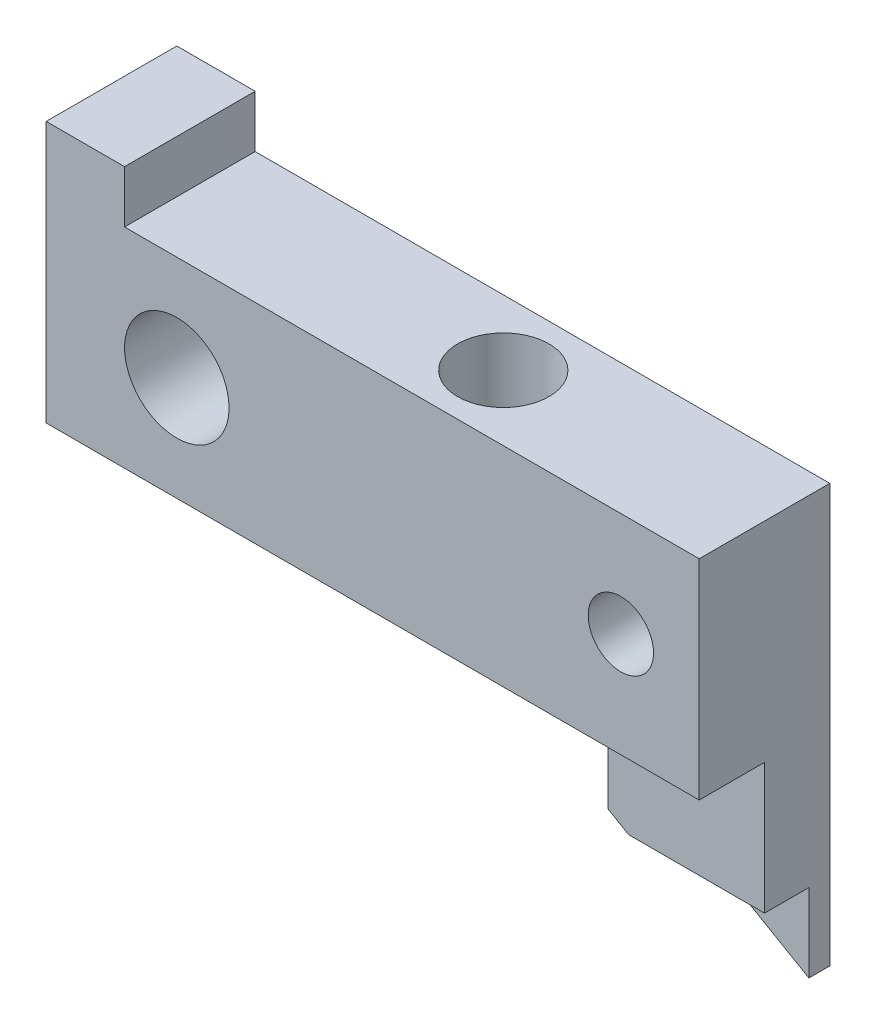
ISO-10303-21;
HEADER;
FILE_DESCRIPTION(('STEP AP214'),'2;1');
FILE_NAME('part.step','',(''),(''),'','','');
FILE_SCHEMA(('AUTOMOTIVE_DESIGN { 1 0 10303 214 1 1 1 1 }'));
ENDSEC;
DATA;
#1=APPLICATION_CONTEXT('core data for automotive mechanical design processes');
#2=APPLICATION_PROTOCOL_DEFINITION('international standard','automotive_design',2000,#1);
#3=PRODUCT_CONTEXT('',#1,'mechanical');
#4=PRODUCT('Part','Part','',(#3));
#5=PRODUCT_RELATED_PRODUCT_CATEGORY('part','',(#4));
#6=PRODUCT_DEFINITION_FORMATION('','',#4);
#7=PRODUCT_DEFINITION_CONTEXT('part definition',#1,'design');
#8=PRODUCT_DEFINITION('design','',#6,#7);
#9=PRODUCT_DEFINITION_SHAPE('','',#8);
#10=(LENGTH_UNIT() NAMED_UNIT(*) SI_UNIT(.MILLI.,.METRE.));
#11=(NAMED_UNIT(*) PLANE_ANGLE_UNIT() SI_UNIT($,.RADIAN.));
#12=(NAMED_UNIT(*) SI_UNIT($,.STERADIAN.) SOLID_ANGLE_UNIT());
#13=UNCERTAINTY_MEASURE_WITH_UNIT(LENGTH_MEASURE(1.E-05),#10,'distance_accuracy_value','');
#14=(GEOMETRIC_REPRESENTATION_CONTEXT(3) GLOBAL_UNCERTAINTY_ASSIGNED_CONTEXT((#13)) GLOBAL_UNIT_ASSIGNED_CONTEXT((#10,
#11,#12)) REPRESENTATION_CONTEXT('',''));
#15=CARTESIAN_POINT('',(0.,0.,0.));
#16=DIRECTION('',(0.,0.,1.));
#17=DIRECTION('',(1.,0.,0.));
#18=AXIS2_PLACEMENT_3D('',#15,#16,#17);
#19=CARTESIAN_POINT('',(19.,8.,5.));
#20=DIRECTION('',(0.,0.,-1.));
#21=DIRECTION('',(-1.,0.,0.));
#22=AXIS2_PLACEMENT_3D('',#19,#20,#21);
#23=PLANE('',#22);
#24=CARTESIAN_POINT('',(22.,12.,5.));
#25=DIRECTION('',(0.,0.,1.));
#26=DIRECTION('',(1.,0.,0.));
#27=AXIS2_PLACEMENT_3D('',#24,#25,#26);
#28=CIRCLE('',#27,1.25);
#29=CARTESIAN_POINT('',(23.25,12.,5.));
#30=VERTEX_POINT('',#29);
#31=EDGE_CURVE('E218',#30,#30,#28,.T.);
#32=ORIENTED_EDGE('',*,*,#31,.F.);
#33=EDGE_LOOP('',(#32));
#34=FACE_BOUND('',#33,.T.);
#35=CARTESIAN_POINT('',(5.,12.,5.));
#36=DIRECTION('',(0.,0.,1.));
#37=DIRECTION('',(1.,0.,0.));
#38=AXIS2_PLACEMENT_3D('',#35,#36,#37);
#39=CIRCLE('',#38,2.);
#40=CARTESIAN_POINT('',(7.,12.,5.));
#41=VERTEX_POINT('',#40);
#42=EDGE_CURVE('E136',#41,#41,#39,.T.);
#43=ORIENTED_EDGE('',*,*,#42,.F.);
#44=EDGE_LOOP('',(#43));
#45=FACE_BOUND('',#44,.T.);
#46=DIRECTION('',(1.,0.,0.));
#47=VECTOR('',#46,1.);
#48=CARTESIAN_POINT('',(0.,8.,5.));
#49=LINE('',#48,#47);
#50=CARTESIAN_POINT('',(0.,8.,5.));
#51=VERTEX_POINT('',#50);
#52=CARTESIAN_POINT('',(25.,8.,5.));
#53=VERTEX_POINT('',#52);
#54=EDGE_CURVE('E128',#51,#53,#49,.T.);
#55=ORIENTED_EDGE('',*,*,#54,.T.);
#56=DIRECTION('',(0.,1.,0.));
#57=VECTOR('',#56,1.);
#58=CARTESIAN_POINT('',(25.,0.,5.));
#59=LINE('',#58,#57);
#60=CARTESIAN_POINT('',(25.,16.,5.));
#61=VERTEX_POINT('',#60);
#62=EDGE_CURVE('E97',#53,#61,#59,.T.);
#63=ORIENTED_EDGE('',*,*,#62,.T.);
#64=DIRECTION('',(-1.,0.,0.));
#65=VECTOR('',#64,1.);
#66=CARTESIAN_POINT('',(3.,16.,5.));
#67=LINE('',#66,#65);
#68=CARTESIAN_POINT('',(3.,16.,5.));
#69=VERTEX_POINT('',#68);
#70=EDGE_CURVE('E110',#61,#69,#67,.T.);
#71=ORIENTED_EDGE('',*,*,#70,.T.);
#72=DIRECTION('',(0.,1.,0.));
#73=VECTOR('',#72,1.);
#74=CARTESIAN_POINT('',(3.,16.,5.));
#75=LINE('',#74,#73);
#76=CARTESIAN_POINT('',(3.,18.,5.));
#77=VERTEX_POINT('',#76);
#78=EDGE_CURVE('E104',#69,#77,#75,.T.);
#79=ORIENTED_EDGE('',*,*,#78,.T.);
#80=DIRECTION('',(-1.,0.,0.));
#81=VECTOR('',#80,1.);
#82=CARTESIAN_POINT('',(0.,18.,5.));
#83=LINE('',#82,#81);
#84=CARTESIAN_POINT('',(0.,18.,5.));
#85=VERTEX_POINT('',#84);
#86=EDGE_CURVE('E107',#77,#85,#83,.T.);
#87=ORIENTED_EDGE('',*,*,#86,.T.);
#88=DIRECTION('',(0.,-1.,0.));
#89=VECTOR('',#88,1.);
#90=CARTESIAN_POINT('',(0.,8.,5.));
#91=LINE('',#90,#89);
#92=EDGE_CURVE('E57',#85,#51,#91,.T.);
#93=ORIENTED_EDGE('',*,*,#92,.T.);
#94=EDGE_LOOP('',(#55,#63,#71,#79,#87,#93));
#95=FACE_BOUND('',#94,.T.);
#96=ADVANCED_FACE('F33',(#34,#45,#95),#23,.F.);
#97=CARTESIAN_POINT('',(19.,3.46410161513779,5.));
#98=DIRECTION('',(1.,0.,0.));
#99=DIRECTION('',(0.,0.,-1.));
#100=AXIS2_PLACEMENT_3D('',#97,#98,#99);
#101=PLANE('',#100);
#102=DIRECTION('',(0.,-1.,0.));
#103=VECTOR('',#102,1.);
#104=CARTESIAN_POINT('',(19.,3.46410161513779,2.5));
#105=LINE('',#104,#103);
#106=CARTESIAN_POINT('',(19.,8.,2.5));
#107=VERTEX_POINT('',#106);
#108=CARTESIAN_POINT('',(19.,3.46410161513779,2.5));
#109=VERTEX_POINT('',#108);
#110=EDGE_CURVE('E199',#107,#109,#105,.T.);
#111=ORIENTED_EDGE('',*,*,#110,.F.);
#112=DIRECTION('',(0.,0.,-1.));
#113=VECTOR('',#112,1.);
#114=CARTESIAN_POINT('',(19.,8.,5.));
#115=LINE('',#114,#113);
#116=CARTESIAN_POINT('',(19.,8.,0.));
#117=VERTEX_POINT('',#116);
#118=EDGE_CURVE('E90',#107,#117,#115,.T.);
#119=ORIENTED_EDGE('',*,*,#118,.T.);
#120=DIRECTION('',(0.,-1.,0.));
#121=VECTOR('',#120,1.);
#122=CARTESIAN_POINT('',(19.,3.46410161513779,0.));
#123=LINE('',#122,#121);
#124=CARTESIAN_POINT('',(19.,3.46410161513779,0.));
#125=VERTEX_POINT('',#124);
#126=EDGE_CURVE('E133',#117,#125,#123,.T.);
#127=ORIENTED_EDGE('',*,*,#126,.T.);
#128=DIRECTION('',(0.,0.,-1.));
#129=VECTOR('',#128,1.);
#130=CARTESIAN_POINT('',(19.,3.46410161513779,5.));
#131=LINE('',#130,#129);
#132=EDGE_CURVE('E12',#109,#125,#131,.T.);
#133=ORIENTED_EDGE('',*,*,#132,.F.);
#134=EDGE_LOOP('',(#111,#119,#127,#133));
#135=FACE_BOUND('',#134,.T.);
#136=ADVANCED_FACE('F35',(#135),#101,.F.);
#137=CARTESIAN_POINT('',(19.,3.46410161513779,5.));
#138=DIRECTION('',(0.500000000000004,0.866025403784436,0.));
#139=DIRECTION('',(-0.866025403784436,0.500000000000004,0.));
#140=AXIS2_PLACEMENT_3D('',#137,#138,#139);
#141=PLANE('',#140);
#142=DIRECTION('',(0.866025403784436,-0.500000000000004,0.));
#143=VECTOR('',#142,1.);
#144=CARTESIAN_POINT('',(19.,3.46410161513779,0.80000000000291));
#145=LINE('',#144,#143);
#146=CARTESIAN_POINT('',(19.8038475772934,3.,0.80000000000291));
#147=VERTEX_POINT('',#146);
#148=CARTESIAN_POINT('',(25.,0.,0.800000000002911));
#149=VERTEX_POINT('',#148);
#150=EDGE_CURVE('E191',#147,#149,#145,.T.);
#151=ORIENTED_EDGE('',*,*,#150,.F.);
#152=DIRECTION('',(0.,0.,-1.));
#153=VECTOR('',#152,1.);
#154=CARTESIAN_POINT('',(19.8038475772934,3.,5.));
#155=LINE('',#154,#153);
#156=CARTESIAN_POINT('',(19.8038475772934,3.,2.5));
#157=VERTEX_POINT('',#156);
#158=EDGE_CURVE('E196',#157,#147,#155,.T.);
#159=ORIENTED_EDGE('',*,*,#158,.F.);
#160=DIRECTION('',(0.866025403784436,-0.500000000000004,0.));
#161=VECTOR('',#160,1.);
#162=CARTESIAN_POINT('',(19.,3.46410161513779,2.5));
#163=LINE('',#162,#161);
#164=EDGE_CURVE('E202',#109,#157,#163,.T.);
#165=ORIENTED_EDGE('',*,*,#164,.F.);
#166=ORIENTED_EDGE('',*,*,#132,.T.);
#167=DIRECTION('',(0.866025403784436,-0.500000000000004,0.));
#168=VECTOR('',#167,1.);
#169=CARTESIAN_POINT('',(19.,3.46410161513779,0.));
#170=LINE('',#169,#168);
#171=CARTESIAN_POINT('',(25.,0.,0.));
#172=VERTEX_POINT('',#171);
#173=EDGE_CURVE('E135',#125,#172,#170,.T.);
#174=ORIENTED_EDGE('',*,*,#173,.T.);
#175=DIRECTION('',(0.,0.,-1.));
#176=VECTOR('',#175,1.);
#177=CARTESIAN_POINT('',(25.,0.,5.));
#178=LINE('',#177,#176);
#179=EDGE_CURVE('E41',#149,#172,#178,.T.);
#180=ORIENTED_EDGE('',*,*,#179,.F.);
#181=EDGE_LOOP('',(#151,#159,#165,#166,#174,#180));
#182=FACE_BOUND('',#181,.T.);
#183=ADVANCED_FACE('F170',(#182),#141,.F.);
#184=CARTESIAN_POINT('',(25.,0.,5.));
#185=DIRECTION('',(-1.,0.,0.));
#186=DIRECTION('',(0.,0.,1.));
#187=AXIS2_PLACEMENT_3D('',#184,#185,#186);
#188=PLANE('',#187);
#189=DIRECTION('',(0.,-1.,0.));
#190=VECTOR('',#189,1.);
#191=CARTESIAN_POINT('',(25.,0.,0.80000000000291));
#192=LINE('',#191,#190);
#193=CARTESIAN_POINT('',(25.,3.,0.80000000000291));
#194=VERTEX_POINT('',#193);
#195=EDGE_CURVE('E166',#194,#149,#192,.T.);
#196=ORIENTED_EDGE('',*,*,#195,.T.);
#197=ORIENTED_EDGE('',*,*,#179,.T.);
#198=DIRECTION('',(0.,1.,0.));
#199=VECTOR('',#198,1.);
#200=CARTESIAN_POINT('',(25.,0.,0.));
#201=LINE('',#200,#199);
#202=CARTESIAN_POINT('',(25.,16.,0.));
#203=VERTEX_POINT('',#202);
#204=EDGE_CURVE('E139',#172,#203,#201,.T.);
#205=ORIENTED_EDGE('',*,*,#204,.T.);
#206=DIRECTION('',(0.,0.,-1.));
#207=VECTOR('',#206,1.);
#208=CARTESIAN_POINT('',(25.,16.,5.));
#209=LINE('',#208,#207);
#210=EDGE_CURVE('E156',#61,#203,#209,.T.);
#211=ORIENTED_EDGE('',*,*,#210,.F.);
#212=ORIENTED_EDGE('',*,*,#62,.F.);
#213=DIRECTION('',(0.,0.,-1.));
#214=VECTOR('',#213,1.);
#215=CARTESIAN_POINT('',(25.,8.,5.));
#216=LINE('',#215,#214);
#217=CARTESIAN_POINT('',(25.,8.,2.5));
#218=VERTEX_POINT('',#217);
#219=EDGE_CURVE('E183',#53,#218,#216,.T.);
#220=ORIENTED_EDGE('',*,*,#219,.T.);
#221=DIRECTION('',(0.,-1.,0.));
#222=VECTOR('',#221,1.);
#223=CARTESIAN_POINT('',(25.,3.,2.5));
#224=LINE('',#223,#222);
#225=CARTESIAN_POINT('',(25.,3.,2.5));
#226=VERTEX_POINT('',#225);
#227=EDGE_CURVE('E48',#218,#226,#224,.T.);
#228=ORIENTED_EDGE('',*,*,#227,.T.);
#229=DIRECTION('',(0.,0.,-1.));
#230=VECTOR('',#229,1.);
#231=CARTESIAN_POINT('',(25.,3.,2.5));
#232=LINE('',#231,#230);
#233=EDGE_CURVE('E209',#226,#194,#232,.T.);
#234=ORIENTED_EDGE('',*,*,#233,.T.);
#235=EDGE_LOOP('',(#196,#197,#205,#211,#212,#220,#228,#234));
#236=FACE_BOUND('',#235,.T.);
#237=ADVANCED_FACE('F161',(#236),#188,.F.);
#238=CARTESIAN_POINT('',(19.,8.,0.));
#239=DIRECTION('',(0.,0.,-1.));
#240=DIRECTION('',(-1.,0.,0.));
#241=AXIS2_PLACEMENT_3D('',#238,#239,#240);
#242=PLANE('',#241);
#243=CARTESIAN_POINT('',(22.,12.,0.));
#244=DIRECTION('',(0.,0.,1.));
#245=DIRECTION('',(1.,0.,0.));
#246=AXIS2_PLACEMENT_3D('',#243,#244,#245);
#247=CIRCLE('',#246,1.25);
#248=CARTESIAN_POINT('',(23.25,12.,0.));
#249=VERTEX_POINT('',#248);
#250=EDGE_CURVE('E217',#249,#249,#247,.T.);
#251=ORIENTED_EDGE('',*,*,#250,.T.);
#252=EDGE_LOOP('',(#251));
#253=FACE_BOUND('',#252,.T.);
#254=ORIENTED_EDGE('',*,*,#126,.F.);
#255=DIRECTION('',(1.,0.,0.));
#256=VECTOR('',#255,1.);
#257=CARTESIAN_POINT('',(0.,8.,0.));
#258=LINE('',#257,#256);
#259=CARTESIAN_POINT('',(0.,8.,0.));
#260=VERTEX_POINT('',#259);
#261=EDGE_CURVE('E149',#260,#117,#258,.T.);
#262=ORIENTED_EDGE('',*,*,#261,.F.);
#263=DIRECTION('',(0.,-1.,0.));
#264=VECTOR('',#263,1.);
#265=CARTESIAN_POINT('',(0.,8.,0.));
#266=LINE('',#265,#264);
#267=CARTESIAN_POINT('',(0.,18.,0.));
#268=VERTEX_POINT('',#267);
#269=EDGE_CURVE('E146',#268,#260,#266,.T.);
#270=ORIENTED_EDGE('',*,*,#269,.F.);
#271=DIRECTION('',(-1.,0.,0.));
#272=VECTOR('',#271,1.);
#273=CARTESIAN_POINT('',(0.,18.,0.));
#274=LINE('',#273,#272);
#275=CARTESIAN_POINT('',(3.,18.,0.));
#276=VERTEX_POINT('',#275);
#277=EDGE_CURVE('E144',#276,#268,#274,.T.);
#278=ORIENTED_EDGE('',*,*,#277,.F.);
#279=DIRECTION('',(0.,1.,0.));
#280=VECTOR('',#279,1.);
#281=CARTESIAN_POINT('',(3.,16.,0.));
#282=LINE('',#281,#280);
#283=CARTESIAN_POINT('',(3.,16.,0.));
#284=VERTEX_POINT('',#283);
#285=EDGE_CURVE('E119',#284,#276,#282,.T.);
#286=ORIENTED_EDGE('',*,*,#285,.F.);
#287=DIRECTION('',(-1.,0.,0.));
#288=VECTOR('',#287,1.);
#289=CARTESIAN_POINT('',(3.,16.,0.));
#290=LINE('',#289,#288);
#291=EDGE_CURVE('E141',#203,#284,#290,.T.);
#292=ORIENTED_EDGE('',*,*,#291,.F.);
#293=ORIENTED_EDGE('',*,*,#204,.F.);
#294=ORIENTED_EDGE('',*,*,#173,.F.);
#295=EDGE_LOOP('',(#254,#262,#270,#278,#286,#292,#293,#294));
#296=FACE_BOUND('',#295,.T.);
#297=CARTESIAN_POINT('',(5.,12.,0.));
#298=DIRECTION('',(0.,0.,1.));
#299=DIRECTION('',(1.,0.,0.));
#300=AXIS2_PLACEMENT_3D('',#297,#298,#299);
#301=CIRCLE('',#300,2.);
#302=CARTESIAN_POINT('',(7.,12.,0.));
#303=VERTEX_POINT('',#302);
#304=EDGE_CURVE('E188',#303,#303,#301,.T.);
#305=ORIENTED_EDGE('',*,*,#304,.T.);
#306=EDGE_LOOP('',(#305));
#307=FACE_BOUND('',#306,.T.);
#308=ADVANCED_FACE('F176',(#253,#296,#307),#242,.T.);
#309=CARTESIAN_POINT('',(3.,16.,5.));
#310=DIRECTION('',(0.,-1.,0.));
#311=DIRECTION('',(0.,0.,-1.));
#312=AXIS2_PLACEMENT_3D('',#309,#310,#311);
#313=PLANE('',#312);
#314=CARTESIAN_POINT('',(15.,16.,2.5));
#315=DIRECTION('',(0.,1.,0.));
#316=DIRECTION('',(0.,0.,1.));
#317=AXIS2_PLACEMENT_3D('',#314,#315,#316);
#318=CIRCLE('',#317,1.75);
#319=CARTESIAN_POINT('',(15.,16.,4.25));
#320=VERTEX_POINT('',#319);
#321=EDGE_CURVE('E224',#320,#320,#318,.T.);
#322=ORIENTED_EDGE('',*,*,#321,.F.);
#323=EDGE_LOOP('',(#322));
#324=FACE_BOUND('',#323,.T.);
#325=ORIENTED_EDGE('',*,*,#291,.T.);
#326=DIRECTION('',(0.,0.,-1.));
#327=VECTOR('',#326,1.);
#328=CARTESIAN_POINT('',(3.,16.,5.));
#329=LINE('',#328,#327);
#330=EDGE_CURVE('E122',#69,#284,#329,.T.);
#331=ORIENTED_EDGE('',*,*,#330,.F.);
#332=ORIENTED_EDGE('',*,*,#70,.F.);
#333=ORIENTED_EDGE('',*,*,#210,.T.);
#334=EDGE_LOOP('',(#325,#331,#332,#333));
#335=FACE_BOUND('',#334,.T.);
#336=ADVANCED_FACE('F179',(#324,#335),#313,.F.);
#337=CARTESIAN_POINT('',(3.,16.,5.));
#338=DIRECTION('',(-1.,0.,0.));
#339=DIRECTION('',(0.,0.,1.));
#340=AXIS2_PLACEMENT_3D('',#337,#338,#339);
#341=PLANE('',#340);
#342=ORIENTED_EDGE('',*,*,#285,.T.);
#343=DIRECTION('',(0.,0.,-1.));
#344=VECTOR('',#343,1.);
#345=CARTESIAN_POINT('',(3.,18.,5.));
#346=LINE('',#345,#344);
#347=EDGE_CURVE('E116',#77,#276,#346,.T.);
#348=ORIENTED_EDGE('',*,*,#347,.F.);
#349=ORIENTED_EDGE('',*,*,#78,.F.);
#350=ORIENTED_EDGE('',*,*,#330,.T.);
#351=EDGE_LOOP('',(#342,#348,#349,#350));
#352=FACE_BOUND('',#351,.T.);
#353=ADVANCED_FACE('F117',(#352),#341,.F.);
#354=CARTESIAN_POINT('',(0.,18.,5.));
#355=DIRECTION('',(0.,-1.,0.));
#356=DIRECTION('',(0.,0.,-1.));
#357=AXIS2_PLACEMENT_3D('',#354,#355,#356);
#358=PLANE('',#357);
#359=ORIENTED_EDGE('',*,*,#277,.T.);
#360=DIRECTION('',(0.,0.,-1.));
#361=VECTOR('',#360,1.);
#362=CARTESIAN_POINT('',(0.,18.,5.));
#363=LINE('',#362,#361);
#364=EDGE_CURVE('E123',#85,#268,#363,.T.);
#365=ORIENTED_EDGE('',*,*,#364,.F.);
#366=ORIENTED_EDGE('',*,*,#86,.F.);
#367=ORIENTED_EDGE('',*,*,#347,.T.);
#368=EDGE_LOOP('',(#359,#365,#366,#367));
#369=FACE_BOUND('',#368,.T.);
#370=ADVANCED_FACE('F125',(#369),#358,.F.);
#371=CARTESIAN_POINT('',(0.,8.,5.));
#372=DIRECTION('',(1.,0.,0.));
#373=DIRECTION('',(0.,0.,-1.));
#374=AXIS2_PLACEMENT_3D('',#371,#372,#373);
#375=PLANE('',#374);
#376=ORIENTED_EDGE('',*,*,#269,.T.);
#377=DIRECTION('',(0.,0.,-1.));
#378=VECTOR('',#377,1.);
#379=CARTESIAN_POINT('',(0.,8.,5.));
#380=LINE('',#379,#378);
#381=EDGE_CURVE('E152',#51,#260,#380,.T.);
#382=ORIENTED_EDGE('',*,*,#381,.F.);
#383=ORIENTED_EDGE('',*,*,#92,.F.);
#384=ORIENTED_EDGE('',*,*,#364,.T.);
#385=EDGE_LOOP('',(#376,#382,#383,#384));
#386=FACE_BOUND('',#385,.T.);
#387=ADVANCED_FACE('F264',(#386),#375,.F.);
#388=CARTESIAN_POINT('',(0.,8.,5.));
#389=DIRECTION('',(0.,1.,0.));
#390=DIRECTION('',(0.,0.,1.));
#391=AXIS2_PLACEMENT_3D('',#388,#389,#390);
#392=PLANE('',#391);
#393=ORIENTED_EDGE('',*,*,#381,.T.);
#394=ORIENTED_EDGE('',*,*,#261,.T.);
#395=ORIENTED_EDGE('',*,*,#118,.F.);
#396=DIRECTION('',(1.,0.,0.));
#397=VECTOR('',#396,1.);
#398=CARTESIAN_POINT('',(0.,8.,2.5));
#399=LINE('',#398,#397);
#400=EDGE_CURVE('E206',#107,#218,#399,.T.);
#401=ORIENTED_EDGE('',*,*,#400,.T.);
#402=ORIENTED_EDGE('',*,*,#219,.F.);
#403=ORIENTED_EDGE('',*,*,#54,.F.);
#404=EDGE_LOOP('',(#393,#394,#395,#401,#402,#403));
#405=FACE_BOUND('',#404,.T.);
#406=ADVANCED_FACE('F261',(#405),#392,.F.);
#407=CARTESIAN_POINT('',(5.,12.,5.));
#408=DIRECTION('',(0.,0.,-1.));
#409=DIRECTION('',(-1.,0.,0.));
#410=AXIS2_PLACEMENT_3D('',#407,#408,#409);
#411=CYLINDRICAL_SURFACE('',#410,2.);
#412=ORIENTED_EDGE('',*,*,#42,.T.);
#413=EDGE_LOOP('',(#412));
#414=FACE_BOUND('',#413,.T.);
#415=ORIENTED_EDGE('',*,*,#304,.F.);
#416=EDGE_LOOP('',(#415));
#417=FACE_BOUND('',#416,.T.);
#418=ADVANCED_FACE('F258',(#414,#417),#411,.F.);
#419=CARTESIAN_POINT('',(0.,0.,0.80000000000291));
#420=DIRECTION('',(0.,0.,1.));
#421=DIRECTION('',(1.,0.,0.));
#422=AXIS2_PLACEMENT_3D('',#419,#420,#421);
#423=PLANE('',#422);
#424=ORIENTED_EDGE('',*,*,#150,.T.);
#425=ORIENTED_EDGE('',*,*,#195,.F.);
#426=DIRECTION('',(1.,0.,0.));
#427=VECTOR('',#426,1.);
#428=CARTESIAN_POINT('',(0.,3.,0.80000000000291));
#429=LINE('',#428,#427);
#430=EDGE_CURVE('E205',#147,#194,#429,.T.);
#431=ORIENTED_EDGE('',*,*,#430,.F.);
#432=EDGE_LOOP('',(#424,#425,#431));
#433=FACE_BOUND('',#432,.T.);
#434=ADVANCED_FACE('F290',(#433),#423,.T.);
#435=CARTESIAN_POINT('',(0.,3.,2.5));
#436=DIRECTION('',(0.,-1.,0.));
#437=DIRECTION('',(0.,0.,-1.));
#438=AXIS2_PLACEMENT_3D('',#435,#436,#437);
#439=PLANE('',#438);
#440=ORIENTED_EDGE('',*,*,#158,.T.);
#441=ORIENTED_EDGE('',*,*,#430,.T.);
#442=ORIENTED_EDGE('',*,*,#233,.F.);
#443=DIRECTION('',(1.,0.,0.));
#444=VECTOR('',#443,1.);
#445=CARTESIAN_POINT('',(0.,3.,2.5));
#446=LINE('',#445,#444);
#447=EDGE_CURVE('E208',#157,#226,#446,.T.);
#448=ORIENTED_EDGE('',*,*,#447,.F.);
#449=EDGE_LOOP('',(#440,#441,#442,#448));
#450=FACE_BOUND('',#449,.T.);
#451=ADVANCED_FACE('F297',(#450),#439,.T.);
#452=CARTESIAN_POINT('',(0.,3.,2.5));
#453=DIRECTION('',(0.,0.,1.));
#454=DIRECTION('',(1.,0.,0.));
#455=AXIS2_PLACEMENT_3D('',#452,#453,#454);
#456=PLANE('',#455);
#457=ORIENTED_EDGE('',*,*,#110,.T.);
#458=ORIENTED_EDGE('',*,*,#164,.T.);
#459=ORIENTED_EDGE('',*,*,#447,.T.);
#460=ORIENTED_EDGE('',*,*,#227,.F.);
#461=ORIENTED_EDGE('',*,*,#400,.F.);
#462=EDGE_LOOP('',(#457,#458,#459,#460,#461));
#463=FACE_BOUND('',#462,.T.);
#464=ADVANCED_FACE('F304',(#463),#456,.T.);
#465=CARTESIAN_POINT('',(22.,12.,0.));
#466=DIRECTION('',(0.,0.,1.));
#467=DIRECTION('',(1.,0.,0.));
#468=AXIS2_PLACEMENT_3D('',#465,#466,#467);
#469=CYLINDRICAL_SURFACE('',#468,1.25);
#470=ORIENTED_EDGE('',*,*,#250,.F.);
#471=EDGE_LOOP('',(#470));
#472=FACE_BOUND('',#471,.T.);
#473=ORIENTED_EDGE('',*,*,#31,.T.);
#474=EDGE_LOOP('',(#473));
#475=FACE_BOUND('',#474,.T.);
#476=ADVANCED_FACE('F235',(#472,#475),#469,.F.);
#477=CARTESIAN_POINT('',(15.,13.,2.5));
#478=DIRECTION('',(0.,1.,0.));
#479=DIRECTION('',(0.,0.,1.));
#480=AXIS2_PLACEMENT_3D('',#477,#478,#479);
#481=CYLINDRICAL_SURFACE('',#480,1.75);
#482=CARTESIAN_POINT('',(15.,13.,2.5));
#483=DIRECTION('',(0.,1.,0.));
#484=DIRECTION('',(0.,0.,1.));
#485=AXIS2_PLACEMENT_3D('',#482,#483,#484);
#486=CIRCLE('',#485,1.75);
#487=CARTESIAN_POINT('',(15.,13.,4.25));
#488=VERTEX_POINT('',#487);
#489=EDGE_CURVE('E221',#488,#488,#486,.T.);
#490=ORIENTED_EDGE('',*,*,#489,.F.);
#491=EDGE_LOOP('',(#490));
#492=FACE_BOUND('',#491,.T.);
#493=ORIENTED_EDGE('',*,*,#321,.T.);
#494=EDGE_LOOP('',(#493));
#495=FACE_BOUND('',#494,.T.);
#496=ADVANCED_FACE('F232',(#492,#495),#481,.F.);
#497=CARTESIAN_POINT('',(15.,13.,2.5));
#498=DIRECTION('',(0.,1.,0.));
#499=DIRECTION('',(0.,0.,1.));
#500=AXIS2_PLACEMENT_3D('',#497,#498,#499);
#501=PLANE('',#500);
#502=ORIENTED_EDGE('',*,*,#489,.T.);
#503=EDGE_LOOP('',(#502));
#504=FACE_BOUND('',#503,.T.);
#505=ADVANCED_FACE('F230',(#504),#501,.T.);
#506=CLOSED_SHELL('',(#96,#136,#183,#237,#308,#336,#353,#370,#387,#406,#418,#434,#451,#464,#476,
#496,#505));
#507=MANIFOLD_SOLID_BREP('B2',#506);
#508=ADVANCED_BREP_SHAPE_REPRESENTATION('',(#18,#507),#14);
#509=SHAPE_DEFINITION_REPRESENTATION(#9,#508);
ENDSEC;
END-ISO-10303-21;
